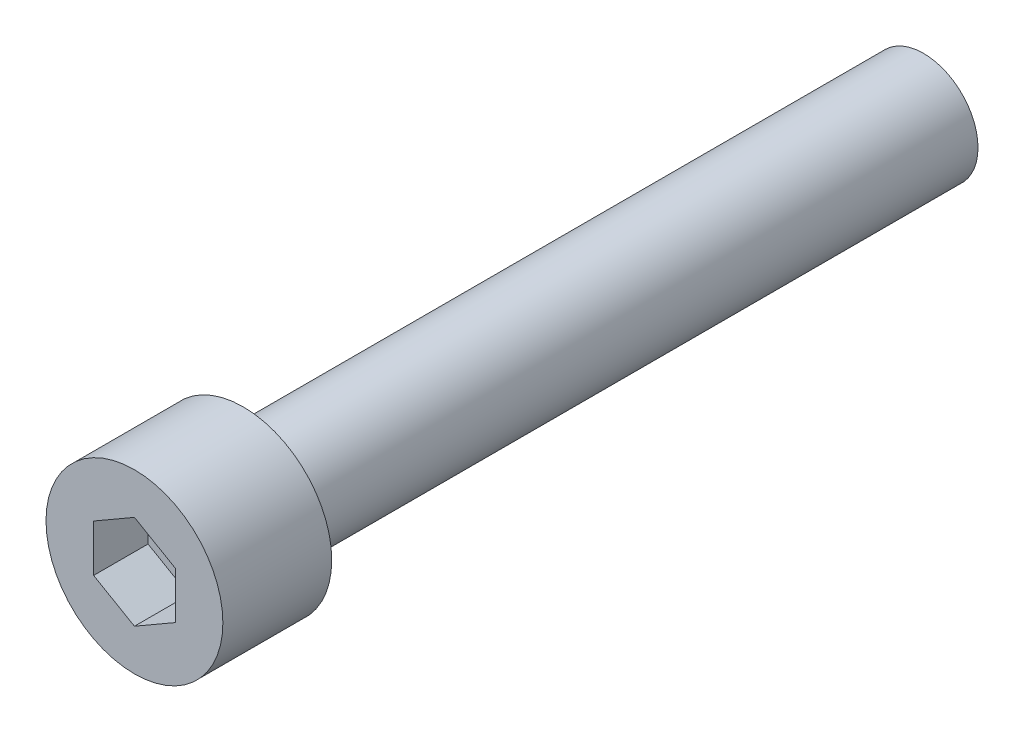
ISO-10303-21;
HEADER;
FILE_DESCRIPTION(('STEP AP214'),'2;1');
FILE_NAME('part.step','',(''),(''),'','','');
FILE_SCHEMA(('AUTOMOTIVE_DESIGN { 1 0 10303 214 1 1 1 1 }'));
ENDSEC;
DATA;
#1=APPLICATION_CONTEXT('core data for automotive mechanical design processes');
#2=APPLICATION_PROTOCOL_DEFINITION('international standard','automotive_design',2000,#1);
#3=PRODUCT_CONTEXT('',#1,'mechanical');
#4=PRODUCT('Part','Part','',(#3));
#5=PRODUCT_RELATED_PRODUCT_CATEGORY('part','',(#4));
#6=PRODUCT_DEFINITION_FORMATION('','',#4);
#7=PRODUCT_DEFINITION_CONTEXT('part definition',#1,'design');
#8=PRODUCT_DEFINITION('design','',#6,#7);
#9=PRODUCT_DEFINITION_SHAPE('','',#8);
#10=(LENGTH_UNIT() NAMED_UNIT(*) SI_UNIT(.MILLI.,.METRE.));
#11=(NAMED_UNIT(*) PLANE_ANGLE_UNIT() SI_UNIT($,.RADIAN.));
#12=(NAMED_UNIT(*) SI_UNIT($,.STERADIAN.) SOLID_ANGLE_UNIT());
#13=UNCERTAINTY_MEASURE_WITH_UNIT(LENGTH_MEASURE(1.E-05),#10,'distance_accuracy_value','');
#14=(GEOMETRIC_REPRESENTATION_CONTEXT(3) GLOBAL_UNCERTAINTY_ASSIGNED_CONTEXT((#13)) GLOBAL_UNIT_ASSIGNED_CONTEXT((#10,
#11,#12)) REPRESENTATION_CONTEXT('',''));
#15=CARTESIAN_POINT('',(0.,0.,0.));
#16=DIRECTION('',(0.,0.,1.));
#17=DIRECTION('',(1.,0.,0.));
#18=AXIS2_PLACEMENT_3D('',#15,#16,#17);
#19=CARTESIAN_POINT('',(0.,3.46410161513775,4.));
#20=DIRECTION('',(-0.5,-0.86602540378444,0.));
#21=DIRECTION('',(0.86602540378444,-0.5,0.));
#22=AXIS2_PLACEMENT_3D('',#19,#20,#21);
#23=PLANE('',#22);
#24=DIRECTION('',(0.,0.,1.));
#25=VECTOR('',#24,1.);
#26=CARTESIAN_POINT('',(3.,1.73205080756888,4.));
#27=LINE('',#26,#25);
#28=CARTESIAN_POINT('',(3.,1.73205080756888,4.));
#29=VERTEX_POINT('',#28);
#30=CARTESIAN_POINT('',(3.,1.73205080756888,8.));
#31=VERTEX_POINT('',#30);
#32=EDGE_CURVE('E63',#29,#31,#27,.T.);
#33=ORIENTED_EDGE('',*,*,#32,.T.);
#34=DIRECTION('',(0.86602540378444,-0.5,0.));
#35=VECTOR('',#34,1.);
#36=CARTESIAN_POINT('',(0.,3.46410161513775,8.));
#37=LINE('',#36,#35);
#38=CARTESIAN_POINT('',(0.,3.46410161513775,8.));
#39=VERTEX_POINT('',#38);
#40=EDGE_CURVE('E29',#39,#31,#37,.T.);
#41=ORIENTED_EDGE('',*,*,#40,.F.);
#42=DIRECTION('',(0.,0.,1.));
#43=VECTOR('',#42,1.);
#44=CARTESIAN_POINT('',(0.,3.46410161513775,4.));
#45=LINE('',#44,#43);
#46=CARTESIAN_POINT('',(0.,3.46410161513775,4.));
#47=VERTEX_POINT('',#46);
#48=EDGE_CURVE('E33',#47,#39,#45,.T.);
#49=ORIENTED_EDGE('',*,*,#48,.F.);
#50=DIRECTION('',(0.86602540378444,-0.5,0.));
#51=VECTOR('',#50,1.);
#52=CARTESIAN_POINT('',(0.,3.46410161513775,4.));
#53=LINE('',#52,#51);
#54=EDGE_CURVE('E65',#47,#29,#53,.T.);
#55=ORIENTED_EDGE('',*,*,#54,.T.);
#56=EDGE_LOOP('',(#33,#41,#49,#55));
#57=FACE_BOUND('',#56,.T.);
#58=ADVANCED_FACE('F14',(#57),#23,.T.);
#59=CARTESIAN_POINT('',(3.,-1.73205080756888,4.));
#60=DIRECTION('',(1.,0.,0.));
#61=DIRECTION('',(0.,0.,-1.));
#62=AXIS2_PLACEMENT_3D('',#59,#60,#61);
#63=PLANE('',#62);
#64=DIRECTION('',(0.,0.,1.));
#65=VECTOR('',#64,1.);
#66=CARTESIAN_POINT('',(3.,-1.73205080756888,4.));
#67=LINE('',#66,#65);
#68=CARTESIAN_POINT('',(3.,-1.73205080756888,4.));
#69=VERTEX_POINT('',#68);
#70=CARTESIAN_POINT('',(3.,-1.73205080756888,8.));
#71=VERTEX_POINT('',#70);
#72=EDGE_CURVE('E70',#69,#71,#67,.T.);
#73=ORIENTED_EDGE('',*,*,#72,.T.);
#74=DIRECTION('',(0.,1.,0.));
#75=VECTOR('',#74,1.);
#76=CARTESIAN_POINT('',(3.,-1.73205080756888,8.));
#77=LINE('',#76,#75);
#78=EDGE_CURVE('E73',#71,#31,#77,.T.);
#79=ORIENTED_EDGE('',*,*,#78,.T.);
#80=ORIENTED_EDGE('',*,*,#32,.F.);
#81=DIRECTION('',(0.,1.,0.));
#82=VECTOR('',#81,1.);
#83=CARTESIAN_POINT('',(3.,-1.73205080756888,4.));
#84=LINE('',#83,#82);
#85=EDGE_CURVE('E99',#69,#29,#84,.T.);
#86=ORIENTED_EDGE('',*,*,#85,.F.);
#87=EDGE_LOOP('',(#73,#79,#80,#86));
#88=FACE_BOUND('',#87,.T.);
#89=ADVANCED_FACE('F74',(#88),#63,.F.);
#90=CARTESIAN_POINT('',(0.,-3.46410161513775,4.));
#91=DIRECTION('',(0.5,-0.86602540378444,0.));
#92=DIRECTION('',(0.86602540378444,0.5,0.));
#93=AXIS2_PLACEMENT_3D('',#90,#91,#92);
#94=PLANE('',#93);
#95=DIRECTION('',(0.,0.,1.));
#96=VECTOR('',#95,1.);
#97=CARTESIAN_POINT('',(0.,-3.46410161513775,4.));
#98=LINE('',#97,#96);
#99=CARTESIAN_POINT('',(0.,-3.46410161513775,4.));
#100=VERTEX_POINT('',#99);
#101=CARTESIAN_POINT('',(0.,-3.46410161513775,8.));
#102=VERTEX_POINT('',#101);
#103=EDGE_CURVE('E107',#100,#102,#98,.T.);
#104=ORIENTED_EDGE('',*,*,#103,.T.);
#105=DIRECTION('',(0.86602540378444,0.5,0.));
#106=VECTOR('',#105,1.);
#107=CARTESIAN_POINT('',(0.,-3.46410161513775,8.));
#108=LINE('',#107,#106);
#109=EDGE_CURVE('E78',#102,#71,#108,.T.);
#110=ORIENTED_EDGE('',*,*,#109,.T.);
#111=ORIENTED_EDGE('',*,*,#72,.F.);
#112=DIRECTION('',(0.86602540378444,0.5,0.));
#113=VECTOR('',#112,1.);
#114=CARTESIAN_POINT('',(0.,-3.46410161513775,4.));
#115=LINE('',#114,#113);
#116=EDGE_CURVE('E96',#100,#69,#115,.T.);
#117=ORIENTED_EDGE('',*,*,#116,.F.);
#118=EDGE_LOOP('',(#104,#110,#111,#117));
#119=FACE_BOUND('',#118,.T.);
#120=ADVANCED_FACE('F140',(#119),#94,.F.);
#121=CARTESIAN_POINT('',(0.,-3.46410161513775,4.));
#122=DIRECTION('',(0.5,0.86602540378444,0.));
#123=DIRECTION('',(-0.86602540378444,0.5,0.));
#124=AXIS2_PLACEMENT_3D('',#121,#122,#123);
#125=PLANE('',#124);
#126=DIRECTION('',(0.,0.,1.));
#127=VECTOR('',#126,1.);
#128=CARTESIAN_POINT('',(-3.,-1.73205080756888,4.));
#129=LINE('',#128,#127);
#130=CARTESIAN_POINT('',(-3.,-1.73205080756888,4.));
#131=VERTEX_POINT('',#130);
#132=CARTESIAN_POINT('',(-3.,-1.73205080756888,8.));
#133=VERTEX_POINT('',#132);
#134=EDGE_CURVE('E105',#131,#133,#129,.T.);
#135=ORIENTED_EDGE('',*,*,#134,.T.);
#136=DIRECTION('',(-0.86602540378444,0.5,0.));
#137=VECTOR('',#136,1.);
#138=CARTESIAN_POINT('',(0.,-3.46410161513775,8.));
#139=LINE('',#138,#137);
#140=EDGE_CURVE('E248',#102,#133,#139,.T.);
#141=ORIENTED_EDGE('',*,*,#140,.F.);
#142=ORIENTED_EDGE('',*,*,#103,.F.);
#143=DIRECTION('',(-0.86602540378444,0.5,0.));
#144=VECTOR('',#143,1.);
#145=CARTESIAN_POINT('',(0.,-3.46410161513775,4.));
#146=LINE('',#145,#144);
#147=EDGE_CURVE('E93',#100,#131,#146,.T.);
#148=ORIENTED_EDGE('',*,*,#147,.T.);
#149=EDGE_LOOP('',(#135,#141,#142,#148));
#150=FACE_BOUND('',#149,.T.);
#151=ADVANCED_FACE('F152',(#150),#125,.T.);
#152=CARTESIAN_POINT('',(-3.,1.73205080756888,4.));
#153=DIRECTION('',(-1.,0.,0.));
#154=DIRECTION('',(0.,-1.,0.));
#155=AXIS2_PLACEMENT_3D('',#152,#153,#154);
#156=PLANE('',#155);
#157=DIRECTION('',(0.,0.,1.));
#158=VECTOR('',#157,1.);
#159=CARTESIAN_POINT('',(-3.,1.73205080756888,4.));
#160=LINE('',#159,#158);
#161=CARTESIAN_POINT('',(-3.,1.73205080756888,4.));
#162=VERTEX_POINT('',#161);
#163=CARTESIAN_POINT('',(-3.,1.73205080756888,8.));
#164=VERTEX_POINT('',#163);
#165=EDGE_CURVE('E103',#162,#164,#160,.T.);
#166=ORIENTED_EDGE('',*,*,#165,.T.);
#167=DIRECTION('',(0.,-1.,0.));
#168=VECTOR('',#167,1.);
#169=CARTESIAN_POINT('',(-3.,1.73205080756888,8.));
#170=LINE('',#169,#168);
#171=EDGE_CURVE('E249',#164,#133,#170,.T.);
#172=ORIENTED_EDGE('',*,*,#171,.T.);
#173=ORIENTED_EDGE('',*,*,#134,.F.);
#174=DIRECTION('',(0.,-1.,0.));
#175=VECTOR('',#174,1.);
#176=CARTESIAN_POINT('',(-3.,1.73205080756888,4.));
#177=LINE('',#176,#175);
#178=EDGE_CURVE('E90',#162,#131,#177,.T.);
#179=ORIENTED_EDGE('',*,*,#178,.F.);
#180=EDGE_LOOP('',(#166,#172,#173,#179));
#181=FACE_BOUND('',#180,.T.);
#182=ADVANCED_FACE('F148',(#181),#156,.F.);
#183=CARTESIAN_POINT('',(0.,3.46410161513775,4.));
#184=DIRECTION('',(-0.5,0.86602540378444,0.));
#185=DIRECTION('',(-0.86602540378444,-0.5,0.));
#186=AXIS2_PLACEMENT_3D('',#183,#184,#185);
#187=PLANE('',#186);
#188=DIRECTION('',(-0.86602540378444,-0.5,0.));
#189=VECTOR('',#188,1.);
#190=CARTESIAN_POINT('',(0.,3.46410161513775,4.));
#191=LINE('',#190,#189);
#192=EDGE_CURVE('E87',#47,#162,#191,.T.);
#193=ORIENTED_EDGE('',*,*,#192,.F.);
#194=ORIENTED_EDGE('',*,*,#48,.T.);
#195=DIRECTION('',(-0.86602540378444,-0.5,0.));
#196=VECTOR('',#195,1.);
#197=CARTESIAN_POINT('',(0.,3.46410161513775,8.));
#198=LINE('',#197,#196);
#199=EDGE_CURVE('E83',#39,#164,#198,.T.);
#200=ORIENTED_EDGE('',*,*,#199,.T.);
#201=ORIENTED_EDGE('',*,*,#165,.F.);
#202=EDGE_LOOP('',(#193,#194,#200,#201));
#203=FACE_BOUND('',#202,.T.);
#204=ADVANCED_FACE('F145',(#203),#187,.F.);
#205=CARTESIAN_POINT('',(-3.,5.19615242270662,4.));
#206=DIRECTION('',(0.,0.,-1.));
#207=DIRECTION('',(-1.,0.,0.));
#208=AXIS2_PLACEMENT_3D('',#205,#206,#207);
#209=PLANE('',#208);
#210=ORIENTED_EDGE('',*,*,#54,.F.);
#211=ORIENTED_EDGE('',*,*,#192,.T.);
#212=ORIENTED_EDGE('',*,*,#178,.T.);
#213=ORIENTED_EDGE('',*,*,#147,.F.);
#214=ORIENTED_EDGE('',*,*,#116,.T.);
#215=ORIENTED_EDGE('',*,*,#85,.T.);
#216=EDGE_LOOP('',(#210,#211,#212,#213,#214,#215));
#217=FACE_BOUND('',#216,.T.);
#218=ADVANCED_FACE('F144',(#217),#209,.F.);
#219=CARTESIAN_POINT('',(0.,0.,8.));
#220=DIRECTION('',(0.,0.,1.));
#221=DIRECTION('',(1.,0.,0.));
#222=AXIS2_PLACEMENT_3D('',#219,#220,#221);
#223=PLANE('',#222);
#224=CARTESIAN_POINT('',(0.,0.,8.));
#225=DIRECTION('',(0.,0.,1.));
#226=DIRECTION('',(1.,0.,0.));
#227=AXIS2_PLACEMENT_3D('',#224,#225,#226);
#228=CIRCLE('',#227,6.5);
#229=CARTESIAN_POINT('',(6.5,0.,8.));
#230=VERTEX_POINT('',#229);
#231=EDGE_CURVE('E9',#230,#230,#228,.T.);
#232=ORIENTED_EDGE('',*,*,#231,.T.);
#233=EDGE_LOOP('',(#232));
#234=FACE_BOUND('',#233,.T.);
#235=ORIENTED_EDGE('',*,*,#199,.F.);
#236=ORIENTED_EDGE('',*,*,#40,.T.);
#237=ORIENTED_EDGE('',*,*,#78,.F.);
#238=ORIENTED_EDGE('',*,*,#109,.F.);
#239=ORIENTED_EDGE('',*,*,#140,.T.);
#240=ORIENTED_EDGE('',*,*,#171,.F.);
#241=EDGE_LOOP('',(#235,#236,#237,#238,#239,#240));
#242=FACE_BOUND('',#241,.T.);
#243=ADVANCED_FACE('F16',(#234,#242),#223,.T.);
#244=CARTESIAN_POINT('',(0.,0.,-30.));
#245=DIRECTION('',(0.,0.,1.));
#246=DIRECTION('',(1.,0.,0.));
#247=AXIS2_PLACEMENT_3D('',#244,#245,#246);
#248=CYLINDRICAL_SURFACE('',#247,6.5);
#249=CARTESIAN_POINT('',(0.,0.,0.));
#250=DIRECTION('',(0.,0.,1.));
#251=DIRECTION('',(1.,0.,0.));
#252=AXIS2_PLACEMENT_3D('',#249,#250,#251);
#253=CIRCLE('',#252,6.5);
#254=CARTESIAN_POINT('',(6.5,0.,0.));
#255=VERTEX_POINT('',#254);
#256=EDGE_CURVE('E22',#255,#255,#253,.T.);
#257=ORIENTED_EDGE('',*,*,#256,.T.);
#258=EDGE_LOOP('',(#257));
#259=FACE_BOUND('',#258,.T.);
#260=ORIENTED_EDGE('',*,*,#231,.F.);
#261=EDGE_LOOP('',(#260));
#262=FACE_BOUND('',#261,.T.);
#263=ADVANCED_FACE('F117',(#259,#262),#248,.T.);
#264=CARTESIAN_POINT('',(6.5,0.,0.));
#265=DIRECTION('',(0.,0.,-1.));
#266=DIRECTION('',(-1.,0.,0.));
#267=AXIS2_PLACEMENT_3D('',#264,#265,#266);
#268=PLANE('',#267);
#269=CARTESIAN_POINT('',(0.,0.,0.));
#270=DIRECTION('',(0.,0.,1.));
#271=DIRECTION('',(1.,0.,0.));
#272=AXIS2_PLACEMENT_3D('',#269,#270,#271);
#273=CIRCLE('',#272,4.);
#274=CARTESIAN_POINT('',(4.,0.,0.));
#275=VERTEX_POINT('',#274);
#276=EDGE_CURVE('E112',#275,#275,#273,.T.);
#277=ORIENTED_EDGE('',*,*,#276,.T.);
#278=EDGE_LOOP('',(#277));
#279=FACE_BOUND('',#278,.T.);
#280=ORIENTED_EDGE('',*,*,#256,.F.);
#281=EDGE_LOOP('',(#280));
#282=FACE_BOUND('',#281,.T.);
#283=ADVANCED_FACE('F120',(#279,#282),#268,.T.);
#284=CARTESIAN_POINT('',(0.,0.,-30.));
#285=DIRECTION('',(0.,0.,1.));
#286=DIRECTION('',(1.,0.,0.));
#287=AXIS2_PLACEMENT_3D('',#284,#285,#286);
#288=CYLINDRICAL_SURFACE('',#287,4.);
#289=CARTESIAN_POINT('',(0.,0.,-50.));
#290=DIRECTION('',(0.,0.,1.));
#291=DIRECTION('',(1.,0.,0.));
#292=AXIS2_PLACEMENT_3D('',#289,#290,#291);
#293=CIRCLE('',#292,4.);
#294=CARTESIAN_POINT('',(4.,0.,-50.));
#295=VERTEX_POINT('',#294);
#296=EDGE_CURVE('E69',#295,#295,#293,.T.);
#297=ORIENTED_EDGE('',*,*,#296,.T.);
#298=EDGE_LOOP('',(#297));
#299=FACE_BOUND('',#298,.T.);
#300=ORIENTED_EDGE('',*,*,#276,.F.);
#301=EDGE_LOOP('',(#300));
#302=FACE_BOUND('',#301,.T.);
#303=ADVANCED_FACE('F122',(#299,#302),#288,.T.);
#304=CARTESIAN_POINT('',(4.,0.,-50.));
#305=DIRECTION('',(0.,0.,-1.));
#306=DIRECTION('',(-1.,0.,0.));
#307=AXIS2_PLACEMENT_3D('',#304,#305,#306);
#308=PLANE('',#307);
#309=ORIENTED_EDGE('',*,*,#296,.F.);
#310=EDGE_LOOP('',(#309));
#311=FACE_BOUND('',#310,.T.);
#312=ADVANCED_FACE('F131',(#311),#308,.T.);
#313=CLOSED_SHELL('',(#58,#89,#120,#151,#182,#204,#218,#243,#263,#283,#303,#312));
#314=MANIFOLD_SOLID_BREP('B1',#313);
#315=ADVANCED_BREP_SHAPE_REPRESENTATION('',(#18,#314),#14);
#316=SHAPE_DEFINITION_REPRESENTATION(#9,#315);
ENDSEC;
END-ISO-10303-21;
